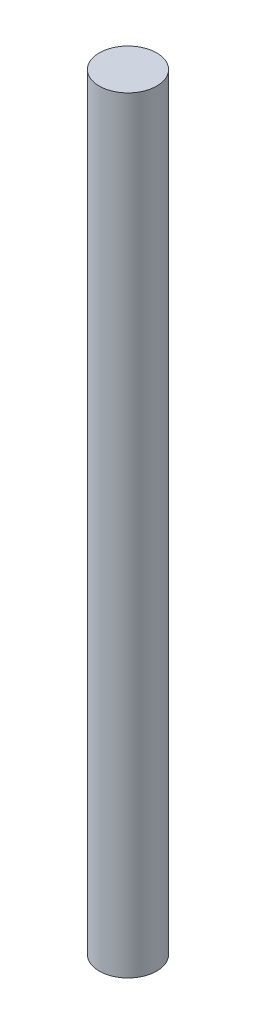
from build123d import *

# Parameters (mm, degrees)
ESQUISSE1_R      = 3
EXTRUSION1_DEPTH = 80


with BuildPart() as part:
    # Esquisse1 → Extrusion1 (new body)
    with BuildSketch(Plane(origin=(0, 0, 0), x_dir=(1, 0, 0), z_dir=(0, 1, 0))):
        with Locations(Location((0, 0, 0), (0, 0, 270))):
            Circle(ESQUISSE1_R)
    extrude(amount=EXTRUSION1_DEPTH)


solid = part.part
